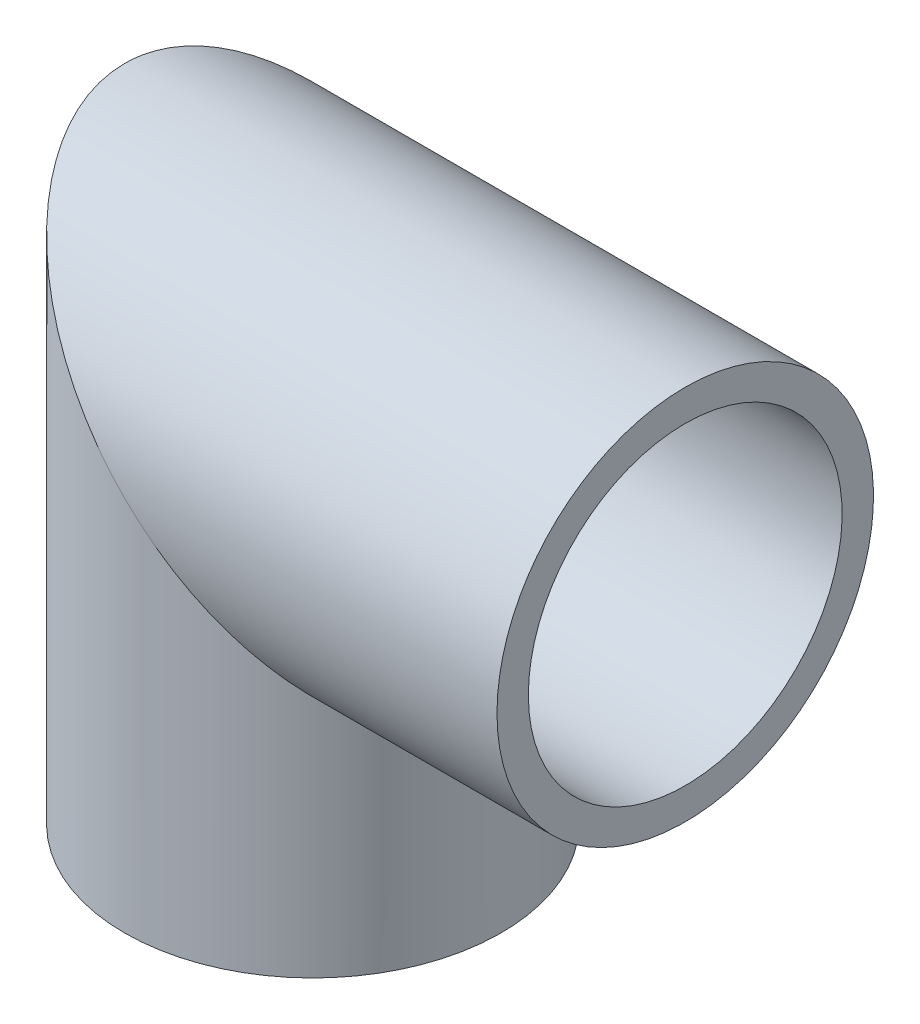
ISO-10303-21;
HEADER;
FILE_DESCRIPTION(('STEP AP214'),'2;1');
FILE_NAME('part.step','',(''),(''),'','','');
FILE_SCHEMA(('AUTOMOTIVE_DESIGN { 1 0 10303 214 1 1 1 1 }'));
ENDSEC;
DATA;
#1=APPLICATION_CONTEXT('core data for automotive mechanical design processes');
#2=APPLICATION_PROTOCOL_DEFINITION('international standard','automotive_design',2000,#1);
#3=PRODUCT_CONTEXT('',#1,'mechanical');
#4=PRODUCT('Part','Part','',(#3));
#5=PRODUCT_RELATED_PRODUCT_CATEGORY('part','',(#4));
#6=PRODUCT_DEFINITION_FORMATION('','',#4);
#7=PRODUCT_DEFINITION_CONTEXT('part definition',#1,'design');
#8=PRODUCT_DEFINITION('design','',#6,#7);
#9=PRODUCT_DEFINITION_SHAPE('','',#8);
#10=(LENGTH_UNIT() NAMED_UNIT(*) SI_UNIT(.MILLI.,.METRE.));
#11=(NAMED_UNIT(*) PLANE_ANGLE_UNIT() SI_UNIT($,.RADIAN.));
#12=(NAMED_UNIT(*) SI_UNIT($,.STERADIAN.) SOLID_ANGLE_UNIT());
#13=UNCERTAINTY_MEASURE_WITH_UNIT(LENGTH_MEASURE(1.E-05),#10,'distance_accuracy_value','');
#14=(GEOMETRIC_REPRESENTATION_CONTEXT(3) GLOBAL_UNCERTAINTY_ASSIGNED_CONTEXT((#13)) GLOBAL_UNIT_ASSIGNED_CONTEXT((#10,
#11,#12)) REPRESENTATION_CONTEXT('',''));
#15=CARTESIAN_POINT('',(0.,0.,0.));
#16=DIRECTION('',(0.,0.,1.));
#17=DIRECTION('',(1.,0.,0.));
#18=AXIS2_PLACEMENT_3D('',#15,#16,#17);
#19=CARTESIAN_POINT('',(-13.3,12.,0.));
#20=DIRECTION('',(1.,0.,0.));
#21=DIRECTION('',(0.,0.,-1.));
#22=AXIS2_PLACEMENT_3D('',#19,#20,#21);
#23=CYLINDRICAL_SURFACE('',#22,6.);
#24=CARTESIAN_POINT('',(0.,12.,0.));
#25=DIRECTION('',(0.707106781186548,0.707106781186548,0.));
#26=DIRECTION('',(-0.707106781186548,0.707106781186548,0.));
#27=AXIS2_PLACEMENT_3D('',#24,#25,#26);
#28=ELLIPSE('',#27,8.48528137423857,6.);
#29=CARTESIAN_POINT('',(-6.,18.,0.));
#30=VERTEX_POINT('',#29);
#31=EDGE_CURVE('E42',#30,#30,#28,.F.);
#32=ORIENTED_EDGE('',*,*,#31,.F.);
#33=EDGE_LOOP('',(#32));
#34=FACE_BOUND('',#33,.T.);
#35=CARTESIAN_POINT('',(11.87,12.,0.));
#36=DIRECTION('',(1.,0.,0.));
#37=DIRECTION('',(0.,0.,1.));
#38=AXIS2_PLACEMENT_3D('',#35,#36,#37);
#39=CIRCLE('',#38,6.);
#40=CARTESIAN_POINT('',(11.87,12.,6.));
#41=VERTEX_POINT('',#40);
#42=EDGE_CURVE('E54',#41,#41,#39,.T.);
#43=ORIENTED_EDGE('',*,*,#42,.F.);
#44=EDGE_LOOP('',(#43));
#45=FACE_BOUND('',#44,.T.);
#46=ADVANCED_FACE('F39',(#34,#45),#23,.T.);
#47=CARTESIAN_POINT('',(0.,0.,0.));
#48=DIRECTION('',(0.,1.,0.));
#49=DIRECTION('',(0.,0.,1.));
#50=AXIS2_PLACEMENT_3D('',#47,#48,#49);
#51=CYLINDRICAL_SURFACE('',#50,6.);
#52=CARTESIAN_POINT('',(0.,0.,0.));
#53=DIRECTION('',(0.,1.,0.));
#54=DIRECTION('',(0.,0.,1.));
#55=AXIS2_PLACEMENT_3D('',#52,#53,#54);
#56=CIRCLE('',#55,6.);
#57=CARTESIAN_POINT('',(0.,0.,6.));
#58=VERTEX_POINT('',#57);
#59=EDGE_CURVE('E60',#58,#58,#56,.T.);
#60=ORIENTED_EDGE('',*,*,#59,.T.);
#61=EDGE_LOOP('',(#60));
#62=FACE_BOUND('',#61,.T.);
#63=ORIENTED_EDGE('',*,*,#31,.T.);
#64=EDGE_LOOP('',(#63));
#65=FACE_BOUND('',#64,.T.);
#66=ADVANCED_FACE('F90',(#62,#65),#51,.T.);
#67=CARTESIAN_POINT('',(11.87,12.,0.));
#68=DIRECTION('',(1.,0.,0.));
#69=DIRECTION('',(0.,0.,1.));
#70=AXIS2_PLACEMENT_3D('',#67,#68,#69);
#71=PLANE('',#70);
#72=CARTESIAN_POINT('',(11.87,12.,0.));
#73=DIRECTION('',(1.,0.,0.));
#74=DIRECTION('',(0.,0.,1.));
#75=AXIS2_PLACEMENT_3D('',#72,#73,#74);
#76=CIRCLE('',#75,5.);
#77=CARTESIAN_POINT('',(11.87,12.,5.));
#78=VERTEX_POINT('',#77);
#79=EDGE_CURVE('E80',#78,#78,#76,.F.);
#80=ORIENTED_EDGE('',*,*,#79,.T.);
#81=EDGE_LOOP('',(#80));
#82=FACE_BOUND('',#81,.T.);
#83=ORIENTED_EDGE('',*,*,#42,.T.);
#84=EDGE_LOOP('',(#83));
#85=FACE_BOUND('',#84,.T.);
#86=ADVANCED_FACE('F92',(#82,#85),#71,.T.);
#87=CARTESIAN_POINT('',(0.,0.,0.));
#88=DIRECTION('',(0.,1.,0.));
#89=DIRECTION('',(0.,0.,1.));
#90=AXIS2_PLACEMENT_3D('',#87,#88,#89);
#91=PLANE('',#90);
#92=CARTESIAN_POINT('',(0.,0.,0.));
#93=DIRECTION('',(0.,1.,0.));
#94=DIRECTION('',(0.,0.,1.));
#95=AXIS2_PLACEMENT_3D('',#92,#93,#94);
#96=CIRCLE('',#95,5.);
#97=CARTESIAN_POINT('',(0.,0.,5.));
#98=VERTEX_POINT('',#97);
#99=EDGE_CURVE('E48',#98,#98,#96,.F.);
#100=ORIENTED_EDGE('',*,*,#99,.F.);
#101=EDGE_LOOP('',(#100));
#102=FACE_BOUND('',#101,.T.);
#103=ORIENTED_EDGE('',*,*,#59,.F.);
#104=EDGE_LOOP('',(#103));
#105=FACE_BOUND('',#104,.T.);
#106=ADVANCED_FACE('F76',(#102,#105),#91,.F.);
#107=CARTESIAN_POINT('',(-11.1,12.,0.));
#108=DIRECTION('',(1.,0.,0.));
#109=DIRECTION('',(0.,0.,-1.));
#110=AXIS2_PLACEMENT_3D('',#107,#108,#109);
#111=CYLINDRICAL_SURFACE('',#110,5.);
#112=CARTESIAN_POINT('',(0.,12.,0.));
#113=DIRECTION('',(0.707106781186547,0.707106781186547,0.));
#114=DIRECTION('',(-0.707106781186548,0.707106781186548,0.));
#115=AXIS2_PLACEMENT_3D('',#112,#113,#114);
#116=ELLIPSE('',#115,7.07106781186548,5.);
#117=CARTESIAN_POINT('',(-5.,17.,0.));
#118=VERTEX_POINT('',#117);
#119=EDGE_CURVE('E11',#118,#118,#116,.T.);
#120=ORIENTED_EDGE('',*,*,#119,.F.);
#121=EDGE_LOOP('',(#120));
#122=FACE_BOUND('',#121,.T.);
#123=ORIENTED_EDGE('',*,*,#79,.F.);
#124=EDGE_LOOP('',(#123));
#125=FACE_BOUND('',#124,.T.);
#126=ADVANCED_FACE('F101',(#122,#125),#111,.F.);
#127=CARTESIAN_POINT('',(0.,0.,0.));
#128=DIRECTION('',(0.,1.,0.));
#129=DIRECTION('',(0.,0.,1.));
#130=AXIS2_PLACEMENT_3D('',#127,#128,#129);
#131=CYLINDRICAL_SURFACE('',#130,5.);
#132=ORIENTED_EDGE('',*,*,#99,.T.);
#133=EDGE_LOOP('',(#132));
#134=FACE_BOUND('',#133,.T.);
#135=ORIENTED_EDGE('',*,*,#119,.T.);
#136=EDGE_LOOP('',(#135));
#137=FACE_BOUND('',#136,.T.);
#138=ADVANCED_FACE('F99',(#134,#137),#131,.F.);
#139=CLOSED_SHELL('',(#46,#66,#86,#106,#126,#138));
#140=MANIFOLD_SOLID_BREP('B2',#139);
#141=ADVANCED_BREP_SHAPE_REPRESENTATION('',(#18,#140),#14);
#142=SHAPE_DEFINITION_REPRESENTATION(#9,#141);
ENDSEC;
END-ISO-10303-21;
